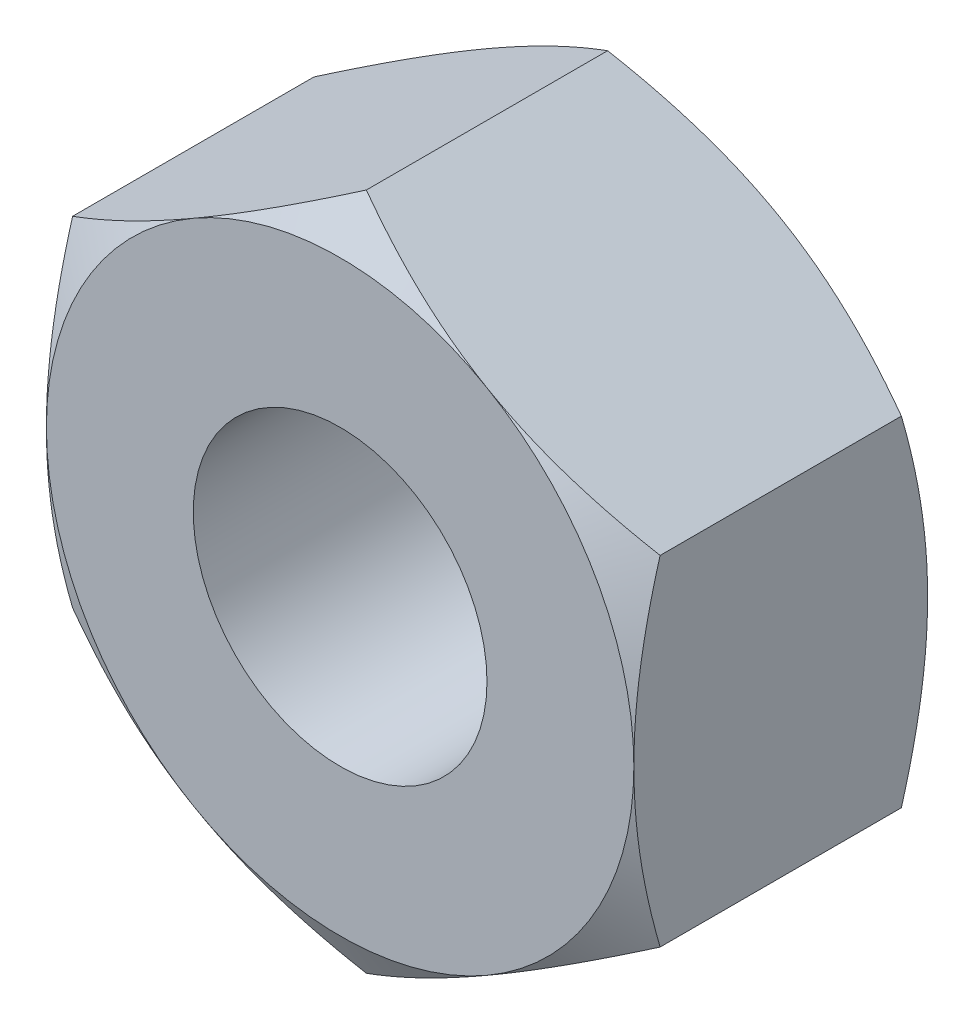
from build123d import *

# Parameters (mm, degrees)
BASE_EXTRUSION_DEPTH    = 8
ESQUISSE3_R             = 5
ENL_V_MAT_EXTRU_1_DEPTH = 15.605934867
ESQUISSE4_R             = 5
ESQUISSE4_R_2           = 4
BOSS_EXTRU_1_DEPTH      = 8


with BuildPart() as part:
    # Esquisse1 → Base-Extrusion (new body)
    with BuildSketch(Plane.XY):
        Polygon((8, -4.618802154), (8, 4.618802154), (0, 9.237604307), (-8, 4.618802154), (-8, -4.618802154), (0, -9.237604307), align=None)
    extrude(amount=-BASE_EXTRUSION_DEPTH)

    # Esquisse2 → Enl_vement de mati_re-R_volution1 (revolve, cut)
    with BuildSketch(Plane(origin=(0, 0, 0), x_dir=(1, 0, 0), z_dir=(0, 1, 0))):
        Polygon((-8, 0), (-15.92820323, 0), (-15.92820323, 8), (-8, 8), (-14.92820323, 4), align=None)
    revolve(axis=Axis((0, 0, -8), (0, 0, 1)), mode=Mode.SUBTRACT)

    # Esquisse3 → Enl_v. mat.-Extru.1 (cut, through all)
    with BuildSketch(Plane.XY):
        Circle(ESQUISSE3_R)
    extrude(amount=-ENL_V_MAT_EXTRU_1_DEPTH, mode=Mode.SUBTRACT)

    # Esquisse4 → Boss.-Extru.1 (add)
    with BuildSketch(Plane.XY):
        Circle(ESQUISSE4_R)
        Circle(ESQUISSE4_R_2, mode=Mode.SUBTRACT)
    extrude(amount=-BOSS_EXTRU_1_DEPTH)


solid = part.part
